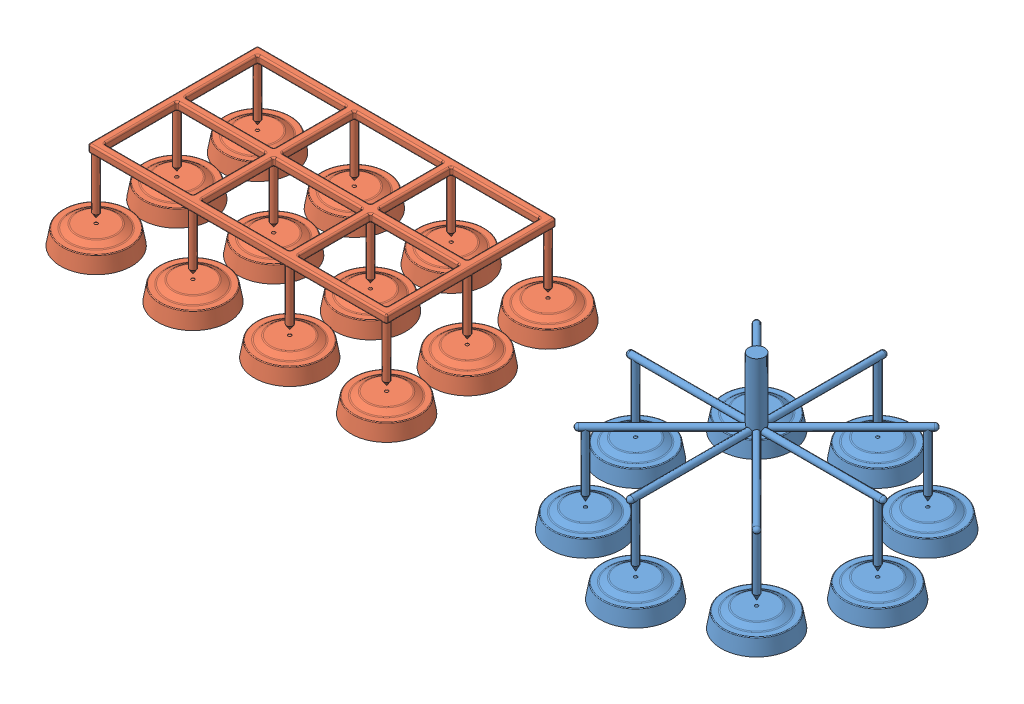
SolidWorks assembly FamilyMolds.SLDASM, configuration Default (file format 11000). Lengths in mm.
Overall size (478.24 97.43 194).
2 component instances, 2 part files, 0 mates.
Components (placement in the parent):
- RadialArray-1: RadialArray.SLDPRT [Default] at (324.4854 147.1005 -54.6902) size (194 95 194)
- GridArray-1: GridArray.SLDPRT [Default] at (70.2487 144.6708 -4.6231) size (224 55 144)
